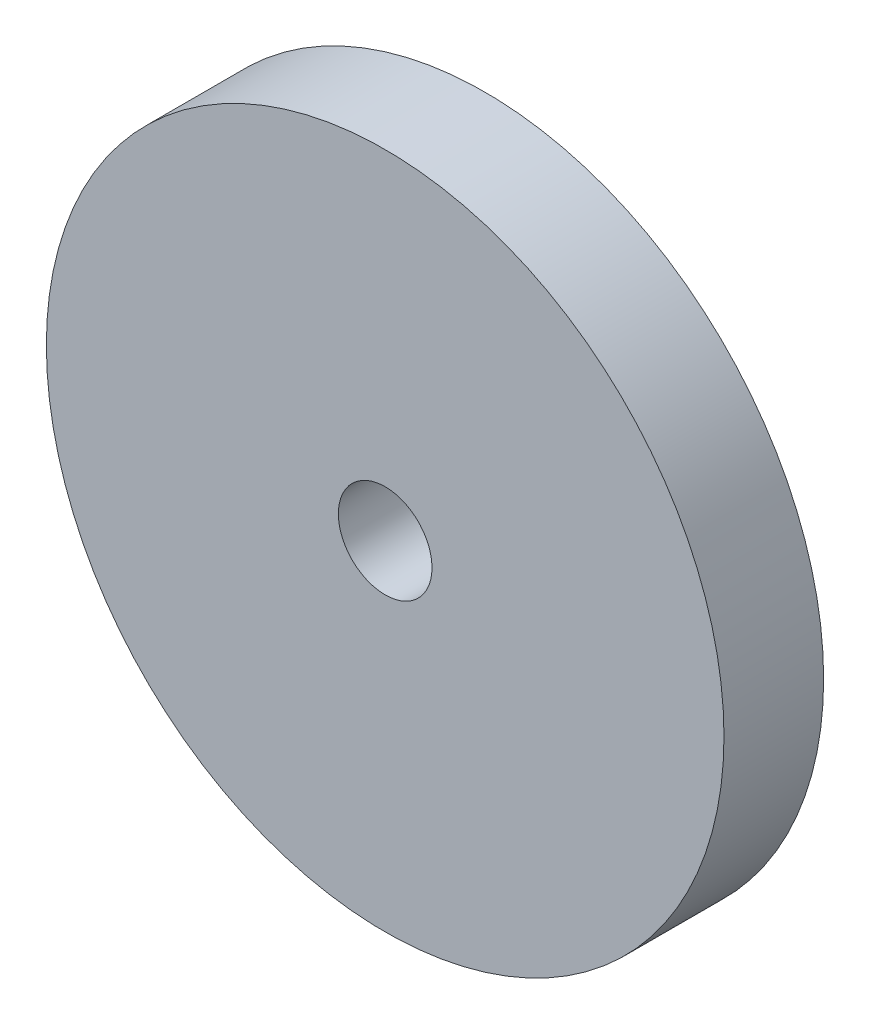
from build123d import *

# Parameters (mm, degrees)
CROQUIS1_R              = 17
CROQUIS1_R_2            = 2.35
SALIENTE_EXTRUIR1_DEPTH = 2.5


with BuildPart() as part:
    # Croquis1 → Saliente-Extruir1 (new, symmetric)
    with BuildSketch(Plane.XY):
        Circle(CROQUIS1_R)
        Circle(CROQUIS1_R_2, mode=Mode.SUBTRACT)
    extrude(amount=SALIENTE_EXTRUIR1_DEPTH, both=True)


solid = part.part
